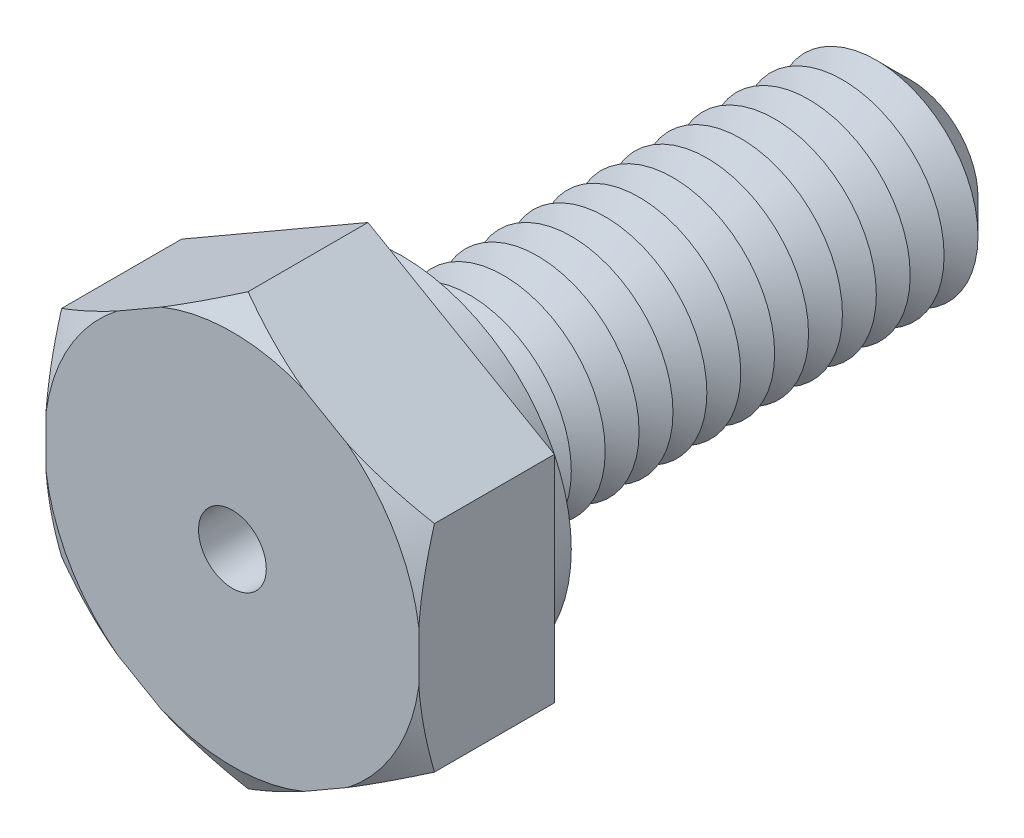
ISO-10303-21;
HEADER;
FILE_DESCRIPTION(('STEP AP214'),'2;1');
FILE_NAME('part.step','',(''),(''),'','','');
FILE_SCHEMA(('AUTOMOTIVE_DESIGN { 1 0 10303 214 1 1 1 1 }'));
ENDSEC;
DATA;
#1=APPLICATION_CONTEXT('core data for automotive mechanical design processes');
#2=APPLICATION_PROTOCOL_DEFINITION('international standard','automotive_design',2000,#1);
#3=PRODUCT_CONTEXT('',#1,'mechanical');
#4=PRODUCT('Part','Part','',(#3));
#5=PRODUCT_RELATED_PRODUCT_CATEGORY('part','',(#4));
#6=PRODUCT_DEFINITION_FORMATION('','',#4);
#7=PRODUCT_DEFINITION_CONTEXT('part definition',#1,'design');
#8=PRODUCT_DEFINITION('design','',#6,#7);
#9=PRODUCT_DEFINITION_SHAPE('','',#8);
#10=(LENGTH_UNIT() NAMED_UNIT(*) SI_UNIT(.MILLI.,.METRE.));
#11=(NAMED_UNIT(*) PLANE_ANGLE_UNIT() SI_UNIT($,.RADIAN.));
#12=(NAMED_UNIT(*) SI_UNIT($,.STERADIAN.) SOLID_ANGLE_UNIT());
#13=UNCERTAINTY_MEASURE_WITH_UNIT(LENGTH_MEASURE(1.E-05),#10,'distance_accuracy_value','');
#14=(GEOMETRIC_REPRESENTATION_CONTEXT(3) GLOBAL_UNCERTAINTY_ASSIGNED_CONTEXT((#13)) GLOBAL_UNIT_ASSIGNED_CONTEXT((#10,
#11,#12)) REPRESENTATION_CONTEXT('',''));
#15=CARTESIAN_POINT('',(0.,0.,0.));
#16=DIRECTION('',(0.,0.,1.));
#17=DIRECTION('',(1.,0.,0.));
#18=AXIS2_PLACEMENT_3D('',#15,#16,#17);
#19=CARTESIAN_POINT('',(2.75,1.58771324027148,2.));
#20=DIRECTION('',(-0.5,-0.866025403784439,0.));
#21=DIRECTION('',(0.866025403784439,-0.5,0.));
#22=AXIS2_PLACEMENT_3D('',#19,#20,#21);
#23=PLANE('',#22);
#24=CARTESIAN_POINT('',(4.66048793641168,0.484692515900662,0.897146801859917));
#25=CARTESIAN_POINT('',(4.57407924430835,0.53458059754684,0.94377821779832));
#26=CARTESIAN_POINT('',(4.48746398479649,0.584587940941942,0.989906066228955));
#27=CARTESIAN_POINT('',(4.31373297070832,0.684891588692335,1.08092005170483));
#28=CARTESIAN_POINT('',(4.22661715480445,0.735187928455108,1.12580603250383));
#29=CARTESIAN_POINT('',(4.05153903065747,0.836269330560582,1.21423144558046));
#30=CARTESIAN_POINT('',(3.96357490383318,0.887055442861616,1.25776609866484));
#31=CARTESIAN_POINT('',(3.78698874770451,0.989007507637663,1.34300583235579));
#32=CARTESIAN_POINT('',(3.69836673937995,1.04017344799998,1.38471097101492));
#33=CARTESIAN_POINT('',(3.42682968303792,1.196945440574,1.50858888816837));
#34=CARTESIAN_POINT('',(3.2426849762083,1.30326143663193,1.58723569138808));
#35=CARTESIAN_POINT('',(2.87039319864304,1.51820419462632,1.73037556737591));
#36=CARTESIAN_POINT('',(2.68225085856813,1.62682822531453,1.7948844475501));
#37=CARTESIAN_POINT('',(2.36072167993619,1.81246318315,1.88587189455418));
#38=CARTESIAN_POINT('',(2.22854222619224,1.88877702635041,1.91793719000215));
#39=CARTESIAN_POINT('',(1.9623222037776,2.04247922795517,1.96931401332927));
#40=CARTESIAN_POINT('',(1.82828230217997,2.11986720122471,1.98862999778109));
#41=CARTESIAN_POINT('',(1.56075616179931,2.27432349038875,2.0122791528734));
#42=CARTESIAN_POINT('',(1.42728171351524,2.35138499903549,2.01678452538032));
#43=CARTESIAN_POINT('',(1.16057863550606,2.50536609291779,2.01073620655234));
#44=CARTESIAN_POINT('',(1.02735002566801,2.58228566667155,2.00018134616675));
#45=CARTESIAN_POINT('',(0.804211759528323,2.71111460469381,1.97079823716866));
#46=CARTESIAN_POINT('',(0.713917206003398,2.76324618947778,1.95563842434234));
#47=CARTESIAN_POINT('',(0.534175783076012,2.86701994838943,1.91960186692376));
#48=CARTESIAN_POINT('',(0.444729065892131,2.91866203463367,1.89872411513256));
#49=CARTESIAN_POINT('',(0.266714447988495,3.02143882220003,1.85203328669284));
#50=CARTESIAN_POINT('',(0.17814764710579,3.07257288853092,1.82621469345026));
#51=CARTESIAN_POINT('',(0.0020075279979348,3.17426743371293,1.77045729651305));
#52=CARTESIAN_POINT('',(-0.08556585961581,3.22482795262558,1.74051878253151));
#53=CARTESIAN_POINT('',(-0.260818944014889,3.3260103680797,1.67685588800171));
#54=CARTESIAN_POINT('',(-0.348487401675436,3.37662577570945,1.64309053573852));
#55=CARTESIAN_POINT('',(-0.522893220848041,3.47731902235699,1.57271678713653));
#56=CARTESIAN_POINT('',(-0.609631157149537,3.52739719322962,1.53611027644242));
#57=CARTESIAN_POINT('',(-0.868655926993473,3.67694521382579,1.4228111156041));
#58=CARTESIAN_POINT('',(-1.03979736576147,3.775753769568,1.34262239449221));
#59=CARTESIAN_POINT('',(-1.26895816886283,3.90805982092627,1.23025748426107));
#60=CARTESIAN_POINT('',(-1.32802105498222,3.94215979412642,1.20084468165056));
#61=CARTESIAN_POINT('',(-1.44588766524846,4.01021011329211,1.14133764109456));
#62=CARTESIAN_POINT('',(-1.50469139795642,4.0441604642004,1.11124342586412));
#63=CARTESIAN_POINT('',(-1.67950896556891,4.14509143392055,1.02069737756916));
#64=CARTESIAN_POINT('',(-1.79518197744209,4.2118752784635,0.959363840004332));
#65=CARTESIAN_POINT('',(-1.91048793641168,4.27844720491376,0.897146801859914));
#66=B_SPLINE_CURVE_WITH_KNOTS('',3,(#24,#25,#26,#27,#28,#29,#30,#31,#32,#33,#34,#35,#36,#37,#38,
#39,#40,#41,#42,#43,#44,#45,#46,#47,#48,#49,#50,#51,#52,#53,#54,#55,#56,#57,#58,#59,#60,#61,#62,
#63,#64,#65),.UNSPECIFIED.,.F.,.F.,(4,2,2,2,2,2,2,2,2,2,2,2,2,2,2,2,2,2,2,2,4),(0.,
0.330408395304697,0.660858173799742,0.992367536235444,1.32386637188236,2.00369971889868,
2.68276903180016,3.15022294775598,3.61751337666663,4.0793510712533,4.54122461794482,
4.85714368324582,5.17311843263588,5.4894480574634,5.80575544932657,6.12584332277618,
6.44572054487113,7.08531613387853,7.30813289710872,7.5309422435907,7.97184194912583),.UNSPECIFIED.);
#67=CARTESIAN_POINT('',(2.75,1.58771324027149,1.76905989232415));
#68=VERTEX_POINT('',#67);
#69=CARTESIAN_POINT('',(1.69960608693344,2.1941584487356,2.));
#70=VERTEX_POINT('',#69);
#71=EDGE_CURVE('E132',#68,#70,#66,.T.);
#72=ORIENTED_EDGE('',*,*,#71,.F.);
#73=DIRECTION('',(0.,0.,-1.));
#74=VECTOR('',#73,1.);
#75=CARTESIAN_POINT('',(2.75,1.58771324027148,2.));
#76=LINE('',#75,#74);
#77=CARTESIAN_POINT('',(2.75,1.58771324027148,0.));
#78=VERTEX_POINT('',#77);
#79=EDGE_CURVE('E144',#68,#78,#76,.T.);
#80=ORIENTED_EDGE('',*,*,#79,.T.);
#81=DIRECTION('',(-0.866025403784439,0.5,0.));
#82=VECTOR('',#81,1.);
#83=CARTESIAN_POINT('',(2.75,1.58771324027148,0.));
#84=LINE('',#83,#82);
#85=CARTESIAN_POINT('',(0.,3.17542648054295,0.));
#86=VERTEX_POINT('',#85);
#87=EDGE_CURVE('E239',#78,#86,#84,.T.);
#88=ORIENTED_EDGE('',*,*,#87,.T.);
#89=DIRECTION('',(0.,0.,-1.));
#90=VECTOR('',#89,1.);
#91=CARTESIAN_POINT('',(0.,3.17542648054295,2.));
#92=LINE('',#91,#90);
#93=CARTESIAN_POINT('',(0.,3.17542648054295,1.76905989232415));
#94=VERTEX_POINT('',#93);
#95=EDGE_CURVE('E179',#94,#86,#92,.T.);
#96=ORIENTED_EDGE('',*,*,#95,.F.);
#97=CARTESIAN_POINT('',(1.05039391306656,2.56898127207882,2.));
#98=VERTEX_POINT('',#97);
#99=EDGE_CURVE('E151',#98,#94,#66,.T.);
#100=ORIENTED_EDGE('',*,*,#99,.F.);
#101=DIRECTION('',(-0.866025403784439,0.5,0.));
#102=VECTOR('',#101,1.);
#103=CARTESIAN_POINT('',(2.75,1.58771324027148,2.));
#104=LINE('',#103,#102);
#105=EDGE_CURVE('E148',#70,#98,#104,.T.);
#106=ORIENTED_EDGE('',*,*,#105,.F.);
#107=EDGE_LOOP('',(#72,#80,#88,#96,#100,#106));
#108=FACE_BOUND('',#107,.T.);
#109=ADVANCED_FACE('F39',(#108),#23,.F.);
#110=CARTESIAN_POINT('',(0.,3.17542648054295,2.));
#111=DIRECTION('',(0.5,-0.866025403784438,0.));
#112=DIRECTION('',(0.866025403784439,0.5,0.));
#113=AXIS2_PLACEMENT_3D('',#110,#111,#112);
#114=PLANE('',#113);
#115=CARTESIAN_POINT('',(1.91048793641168,4.27844720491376,0.897146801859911));
#116=CARTESIAN_POINT('',(1.82407924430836,4.22855912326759,0.943778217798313));
#117=CARTESIAN_POINT('',(1.7374639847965,4.17855177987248,0.989906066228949));
#118=CARTESIAN_POINT('',(1.56373297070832,4.07824813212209,1.08092005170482));
#119=CARTESIAN_POINT('',(1.47661715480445,4.02795179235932,1.12580603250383));
#120=CARTESIAN_POINT('',(1.30153903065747,3.92687039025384,1.21423144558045));
#121=CARTESIAN_POINT('',(1.21357490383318,3.87608427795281,1.25776609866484));
#122=CARTESIAN_POINT('',(1.03698874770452,3.77413221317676,1.34300583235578));
#123=CARTESIAN_POINT('',(0.948366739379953,3.72296627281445,1.38471097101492));
#124=CARTESIAN_POINT('',(0.676829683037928,3.56619428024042,1.50858888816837));
#125=CARTESIAN_POINT('',(0.492684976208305,3.4598782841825,1.58723569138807));
#126=CARTESIAN_POINT('',(0.120393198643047,3.24493552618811,1.73037556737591));
#127=CARTESIAN_POINT('',(-0.0677491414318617,3.1363114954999,1.7948844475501));
#128=CARTESIAN_POINT('',(-0.389278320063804,2.95067653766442,1.88587189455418));
#129=CARTESIAN_POINT('',(-0.521457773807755,2.87436269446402,1.91793719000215));
#130=CARTESIAN_POINT('',(-0.787677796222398,2.72066049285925,1.96931401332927));
#131=CARTESIAN_POINT('',(-0.921717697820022,2.64327251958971,1.98862999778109));
#132=CARTESIAN_POINT('',(-1.18924383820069,2.48881623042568,2.0122791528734));
#133=CARTESIAN_POINT('',(-1.32271828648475,2.41175472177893,2.01678452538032));
#134=CARTESIAN_POINT('',(-1.58942136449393,2.25777362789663,2.01073620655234));
#135=CARTESIAN_POINT('',(-1.72264997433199,2.18085405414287,2.00018134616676));
#136=CARTESIAN_POINT('',(-1.94578824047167,2.05202511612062,1.97079823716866));
#137=CARTESIAN_POINT('',(-2.03608279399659,1.99989353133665,1.95563842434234));
#138=CARTESIAN_POINT('',(-2.21582421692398,1.896119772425,1.91960186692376));
#139=CARTESIAN_POINT('',(-2.30527093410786,1.84447768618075,1.89872411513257));
#140=CARTESIAN_POINT('',(-2.48328555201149,1.7417008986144,1.85203328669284));
#141=CARTESIAN_POINT('',(-2.5718523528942,1.69056683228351,1.82621469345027));
#142=CARTESIAN_POINT('',(-2.74799247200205,1.5888722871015,1.77045729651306));
#143=CARTESIAN_POINT('',(-2.8355658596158,1.53831176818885,1.74051878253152));
#144=CARTESIAN_POINT('',(-3.01081894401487,1.43712935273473,1.67685588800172));
#145=CARTESIAN_POINT('',(-3.09848740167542,1.38651394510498,1.64309053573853));
#146=CARTESIAN_POINT('',(-3.27289322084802,1.28582069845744,1.57271678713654));
#147=CARTESIAN_POINT('',(-3.35963115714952,1.23574252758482,1.53611027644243));
#148=CARTESIAN_POINT('',(-3.61865592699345,1.08619450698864,1.42281111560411));
#149=CARTESIAN_POINT('',(-3.78979736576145,0.987385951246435,1.34262239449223));
#150=CARTESIAN_POINT('',(-4.01895816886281,0.855079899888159,1.23025748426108));
#151=CARTESIAN_POINT('',(-4.0780210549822,0.820979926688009,1.20084468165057));
#152=CARTESIAN_POINT('',(-4.19588766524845,0.752929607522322,1.14133764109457));
#153=CARTESIAN_POINT('',(-4.25469139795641,0.718979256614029,1.11124342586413));
#154=CARTESIAN_POINT('',(-4.42950896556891,0.618048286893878,1.02069737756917));
#155=CARTESIAN_POINT('',(-4.54518197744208,0.551264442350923,0.959363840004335));
#156=CARTESIAN_POINT('',(-4.66048793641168,0.484692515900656,0.897146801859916));
#157=B_SPLINE_CURVE_WITH_KNOTS('',3,(#115,#116,#117,#118,#119,#120,#121,#122,#123,#124,#125,
#126,#127,#128,#129,#130,#131,#132,#133,#134,#135,#136,#137,#138,#139,#140,#141,#142,#143,#144,
#145,#146,#147,#148,#149,#150,#151,#152,#153,#154,#155,#156),.UNSPECIFIED.,.F.,.F.,(4,2,2,2,2,2,
2,2,2,2,2,2,2,2,2,2,2,2,2,2,4),(0.,0.330408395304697,0.660858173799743,0.992367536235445,
1.32386637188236,2.00369971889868,2.68276903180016,3.15022294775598,3.61751337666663,
4.0793510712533,4.54122461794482,4.85714368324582,5.17311843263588,5.48944805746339,
5.80575544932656,6.12584332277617,6.44572054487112,7.08531613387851,7.30813289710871,
7.5309422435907,7.97184194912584),.UNSPECIFIED.);
#158=CARTESIAN_POINT('',(-1.05039391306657,2.56898127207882,2.));
#159=VERTEX_POINT('',#158);
#160=EDGE_CURVE('E382',#94,#159,#157,.T.);
#161=ORIENTED_EDGE('',*,*,#160,.F.);
#162=ORIENTED_EDGE('',*,*,#95,.T.);
#163=DIRECTION('',(-0.866025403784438,-0.5,0.));
#164=VECTOR('',#163,1.);
#165=CARTESIAN_POINT('',(0.,3.17542648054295,0.));
#166=LINE('',#165,#164);
#167=CARTESIAN_POINT('',(-2.75,1.58771324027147,0.));
#168=VERTEX_POINT('',#167);
#169=EDGE_CURVE('E242',#86,#168,#166,.T.);
#170=ORIENTED_EDGE('',*,*,#169,.T.);
#171=DIRECTION('',(0.,0.,-1.));
#172=VECTOR('',#171,1.);
#173=CARTESIAN_POINT('',(-2.75,1.58771324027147,2.));
#174=LINE('',#173,#172);
#175=CARTESIAN_POINT('',(-2.75,1.58771324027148,1.76905989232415));
#176=VERTEX_POINT('',#175);
#177=EDGE_CURVE('E176',#176,#168,#174,.T.);
#178=ORIENTED_EDGE('',*,*,#177,.F.);
#179=CARTESIAN_POINT('',(-1.69960608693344,2.1941584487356,2.));
#180=VERTEX_POINT('',#179);
#181=EDGE_CURVE('E374',#180,#176,#157,.T.);
#182=ORIENTED_EDGE('',*,*,#181,.F.);
#183=DIRECTION('',(-0.866025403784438,-0.5,0.));
#184=VECTOR('',#183,1.);
#185=CARTESIAN_POINT('',(0.,3.17542648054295,2.));
#186=LINE('',#185,#184);
#187=EDGE_CURVE('E218',#159,#180,#186,.T.);
#188=ORIENTED_EDGE('',*,*,#187,.F.);
#189=EDGE_LOOP('',(#161,#162,#170,#178,#182,#188));
#190=FACE_BOUND('',#189,.T.);
#191=ADVANCED_FACE('F388',(#190),#114,.F.);
#192=CARTESIAN_POINT('',(-2.75,1.58771324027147,2.));
#193=DIRECTION('',(1.,0.,0.));
#194=DIRECTION('',(0.,0.,-1.));
#195=AXIS2_PLACEMENT_3D('',#192,#193,#194);
#196=PLANE('',#195);
#197=CARTESIAN_POINT('',(-2.75,3.49820117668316,1.03335245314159));
#198=CARTESIAN_POINT('',(-2.75,3.3988452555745,1.07843728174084));
#199=CARTESIAN_POINT('',(-2.75,3.29921780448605,1.12293477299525));
#200=CARTESIAN_POINT('',(-2.75,3.09930320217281,1.21047025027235));
#201=CARTESIAN_POINT('',(-2.75,2.99901593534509,1.25350797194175));
#202=CARTESIAN_POINT('',(-2.75,2.79728071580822,1.33799855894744));
#203=CARTESIAN_POINT('',(-2.75,2.69582966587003,1.37944406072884));
#204=CARTESIAN_POINT('',(-2.75,2.49207131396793,1.46016516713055));
#205=CARTESIAN_POINT('',(-2.75,2.38976405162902,1.49944087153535));
#206=CARTESIAN_POINT('',(-2.75,2.18462050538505,1.57517230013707));
#207=CARTESIAN_POINT('',(-2.75,2.0817886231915,1.61163983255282));
#208=CARTESIAN_POINT('',(-2.75,1.87503931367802,1.68134876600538));
#209=CARTESIAN_POINT('',(-2.75,1.7711218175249,1.71458996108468));
#210=CARTESIAN_POINT('',(-2.75,1.45784948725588,1.80833694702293));
#211=CARTESIAN_POINT('',(-2.75,1.24663799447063,1.86299520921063));
#212=CARTESIAN_POINT('',(-2.75,0.880007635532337,1.93741428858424));
#213=CARTESIAN_POINT('',(-2.75,0.725721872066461,1.96267397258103));
#214=CARTESIAN_POINT('',(-2.75,0.415477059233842,1.99905142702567));
#215=CARTESIAN_POINT('',(-2.75,0.259518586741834,2.01017392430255));
#216=CARTESIAN_POINT('',(-2.75,-0.052664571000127,2.01694102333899));
#217=CARTESIAN_POINT('',(-2.75,-0.208889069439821,2.01259389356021));
#218=CARTESIAN_POINT('',(-2.75,-0.520179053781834,1.98898893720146));
#219=CARTESIAN_POINT('',(-2.75,-0.675244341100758,1.96972861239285));
#220=CARTESIAN_POINT('',(-2.75,-1.0603123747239,1.90556109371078));
#221=CARTESIAN_POINT('',(-2.75,-1.28896433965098,1.85264132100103));
#222=CARTESIAN_POINT('',(-2.75,-1.62776674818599,1.75827794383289));
#223=CARTESIAN_POINT('',(-2.75,-1.74015276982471,1.72427052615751));
#224=CARTESIAN_POINT('',(-2.75,-1.96362143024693,1.65220283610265));
#225=CARTESIAN_POINT('',(-2.75,-2.07470418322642,1.61414292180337));
#226=CARTESIAN_POINT('',(-2.75,-2.2969572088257,1.53431422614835));
#227=CARTESIAN_POINT('',(-2.75,-2.40811380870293,1.49250783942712));
#228=CARTESIAN_POINT('',(-2.75,-2.62938860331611,1.40621968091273));
#229=CARTESIAN_POINT('',(-2.75,-2.73950673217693,1.36173774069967));
#230=CARTESIAN_POINT('',(-2.75,-2.95816234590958,1.27090723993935));
#231=CARTESIAN_POINT('',(-2.75,-3.06670540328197,1.22457202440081));
#232=CARTESIAN_POINT('',(-2.75,-3.2830047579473,1.130169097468));
#233=CARTESIAN_POINT('',(-2.75,-3.39076124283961,1.08210181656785));
#234=CARTESIAN_POINT('',(-2.75,-3.49820117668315,1.03335245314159));
#235=B_SPLINE_CURVE_WITH_KNOTS('',3,(#197,#198,#199,#200,#201,#202,#203,#204,#205,#206,#207,
#208,#209,#210,#211,#212,#213,#214,#215,#216,#217,#218,#219,#220,#221,#222,#223,#224,#225,#226,
#227,#228,#229,#230,#231,#232,#233,#234),.UNSPECIFIED.,.F.,.F.,(4,2,2,2,2,2,2,2,2,2,2,2,2,2,2,2,
2,2,4),(0.,0.327324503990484,0.654707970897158,0.983457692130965,1.31219228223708,
1.63945907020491,1.96674673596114,2.62024190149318,3.08872929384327,3.55706000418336,
4.02514043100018,4.49329928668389,5.19584793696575,5.54806763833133,5.9002562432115,
6.25649337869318,6.61275296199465,6.96679459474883,7.32074883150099),.UNSPECIFIED.);
#236=CARTESIAN_POINT('',(-2.75,0.374822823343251,2.));
#237=VERTEX_POINT('',#236);
#238=EDGE_CURVE('E225',#176,#237,#235,.T.);
#239=ORIENTED_EDGE('',*,*,#238,.F.);
#240=ORIENTED_EDGE('',*,*,#177,.T.);
#241=DIRECTION('',(0.,-1.,0.));
#242=VECTOR('',#241,1.);
#243=CARTESIAN_POINT('',(-2.75,1.58771324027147,0.));
#244=LINE('',#243,#242);
#245=CARTESIAN_POINT('',(-2.75,-1.58771324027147,0.));
#246=VERTEX_POINT('',#245);
#247=EDGE_CURVE('E246',#168,#246,#244,.T.);
#248=ORIENTED_EDGE('',*,*,#247,.T.);
#249=DIRECTION('',(0.,0.,-1.));
#250=VECTOR('',#249,1.);
#251=CARTESIAN_POINT('',(-2.75,-1.58771324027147,2.));
#252=LINE('',#251,#250);
#253=CARTESIAN_POINT('',(-2.75000000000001,-1.58771324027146,1.76905989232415));
#254=VERTEX_POINT('',#253);
#255=EDGE_CURVE('E173',#254,#246,#252,.T.);
#256=ORIENTED_EDGE('',*,*,#255,.F.);
#257=CARTESIAN_POINT('',(-2.75,-0.374822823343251,2.));
#258=VERTEX_POINT('',#257);
#259=EDGE_CURVE('E228',#258,#254,#235,.T.);
#260=ORIENTED_EDGE('',*,*,#259,.F.);
#261=DIRECTION('',(0.,-1.,0.));
#262=VECTOR('',#261,1.);
#263=CARTESIAN_POINT('',(-2.75,1.58771324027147,2.));
#264=LINE('',#263,#262);
#265=EDGE_CURVE('E216',#237,#258,#264,.T.);
#266=ORIENTED_EDGE('',*,*,#265,.F.);
#267=EDGE_LOOP('',(#239,#240,#248,#256,#260,#266));
#268=FACE_BOUND('',#267,.T.);
#269=ADVANCED_FACE('F224',(#268),#196,.F.);
#270=CARTESIAN_POINT('',(-2.75,-1.58771324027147,2.));
#271=DIRECTION('',(0.5,0.866025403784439,0.));
#272=DIRECTION('',(-0.866025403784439,0.5,0.));
#273=AXIS2_PLACEMENT_3D('',#270,#271,#272);
#274=PLANE('',#273);
#275=CARTESIAN_POINT('',(-4.66048793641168,-0.48469251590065,0.897146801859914));
#276=CARTESIAN_POINT('',(-4.57407924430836,-0.534580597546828,0.943778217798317));
#277=CARTESIAN_POINT('',(-4.4874639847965,-0.58458794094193,0.989906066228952));
#278=CARTESIAN_POINT('',(-4.31373297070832,-0.684891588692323,1.08092005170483));
#279=CARTESIAN_POINT('',(-4.22661715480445,-0.735187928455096,1.12580603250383));
#280=CARTESIAN_POINT('',(-4.05153903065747,-0.836269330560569,1.21423144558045));
#281=CARTESIAN_POINT('',(-3.96357490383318,-0.887055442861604,1.25776609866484));
#282=CARTESIAN_POINT('',(-3.78698874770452,-0.989007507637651,1.34300583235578));
#283=CARTESIAN_POINT('',(-3.69836673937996,-1.04017344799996,1.38471097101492));
#284=CARTESIAN_POINT('',(-3.42682968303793,-1.19694544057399,1.50858888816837));
#285=CARTESIAN_POINT('',(-3.24268497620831,-1.30326143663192,1.58723569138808));
#286=CARTESIAN_POINT('',(-2.87039319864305,-1.5182041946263,1.73037556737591));
#287=CARTESIAN_POINT('',(-2.68225085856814,-1.62682822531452,1.7948844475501));
#288=CARTESIAN_POINT('',(-2.3607216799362,-1.81246318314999,1.88587189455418));
#289=CARTESIAN_POINT('',(-2.22854222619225,-1.8887770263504,1.91793719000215));
#290=CARTESIAN_POINT('',(-1.96232220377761,-2.04247922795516,1.96931401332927));
#291=CARTESIAN_POINT('',(-1.82828230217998,-2.1198672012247,1.9886299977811));
#292=CARTESIAN_POINT('',(-1.56075616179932,-2.27432349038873,2.0122791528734));
#293=CARTESIAN_POINT('',(-1.42728171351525,-2.35138499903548,2.01678452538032));
#294=CARTESIAN_POINT('',(-1.16057863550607,-2.50536609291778,2.01073620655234));
#295=CARTESIAN_POINT('',(-1.02735002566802,-2.58228566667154,2.00018134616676));
#296=CARTESIAN_POINT('',(-0.804211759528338,-2.71111460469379,1.97079823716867));
#297=CARTESIAN_POINT('',(-0.713917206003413,-2.76324618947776,1.95563842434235));
#298=CARTESIAN_POINT('',(-0.534175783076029,-2.86701994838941,1.91960186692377));
#299=CARTESIAN_POINT('',(-0.444729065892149,-2.91866203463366,1.89872411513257));
#300=CARTESIAN_POINT('',(-0.266714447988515,-3.02143882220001,1.85203328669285));
#301=CARTESIAN_POINT('',(-0.178147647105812,-3.0725728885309,1.82621469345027));
#302=CARTESIAN_POINT('',(-0.00200752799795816,-3.17426743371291,1.77045729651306));
#303=CARTESIAN_POINT('',(0.0855658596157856,-3.22482795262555,1.74051878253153));
#304=CARTESIAN_POINT('',(0.260818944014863,-3.32601036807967,1.67685588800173));
#305=CARTESIAN_POINT('',(0.348487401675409,-3.37662577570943,1.64309053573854));
#306=CARTESIAN_POINT('',(0.522893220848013,-3.47731902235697,1.57271678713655));
#307=CARTESIAN_POINT('',(0.609631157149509,-3.52739719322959,1.53611027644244));
#308=CARTESIAN_POINT('',(0.868655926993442,-3.67694521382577,1.42281111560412));
#309=CARTESIAN_POINT('',(1.03979736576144,-3.77575376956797,1.34262239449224));
#310=CARTESIAN_POINT('',(1.26895816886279,-3.90805982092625,1.23025748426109));
#311=CARTESIAN_POINT('',(1.32802105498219,-3.9421597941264,1.20084468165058));
#312=CARTESIAN_POINT('',(1.44588766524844,-4.01021011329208,1.14133764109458));
#313=CARTESIAN_POINT('',(1.5046913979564,-4.04416046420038,1.11124342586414));
#314=CARTESIAN_POINT('',(1.6795089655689,-4.14509143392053,1.02069737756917));
#315=CARTESIAN_POINT('',(1.79518197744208,-4.21187527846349,0.959363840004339));
#316=CARTESIAN_POINT('',(1.91048793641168,-4.27844720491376,0.897146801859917));
#317=B_SPLINE_CURVE_WITH_KNOTS('',3,(#275,#276,#277,#278,#279,#280,#281,#282,#283,#284,#285,
#286,#287,#288,#289,#290,#291,#292,#293,#294,#295,#296,#297,#298,#299,#300,#301,#302,#303,#304,
#305,#306,#307,#308,#309,#310,#311,#312,#313,#314,#315,#316),.UNSPECIFIED.,.F.,.F.,(4,2,2,2,2,2,
2,2,2,2,2,2,2,2,2,2,2,2,2,2,4),(0.,0.330408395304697,0.660858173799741,0.992367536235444,
1.32386637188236,2.00369971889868,2.68276903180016,3.15022294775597,3.61751337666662,
4.0793510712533,4.54122461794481,4.85714368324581,5.17311843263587,5.48944805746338,
5.80575544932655,6.12584332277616,6.44572054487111,7.08531613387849,7.3081328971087,
7.53094224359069,7.97184194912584),.UNSPECIFIED.);
#318=CARTESIAN_POINT('',(-1.69960608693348,-2.19415844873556,2.));
#319=VERTEX_POINT('',#318);
#320=EDGE_CURVE('E424',#254,#319,#317,.T.);
#321=ORIENTED_EDGE('',*,*,#320,.F.);
#322=ORIENTED_EDGE('',*,*,#255,.T.);
#323=DIRECTION('',(0.866025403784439,-0.5,0.));
#324=VECTOR('',#323,1.);
#325=CARTESIAN_POINT('',(-2.75,-1.58771324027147,0.));
#326=LINE('',#325,#324);
#327=CARTESIAN_POINT('',(0.,-3.17542648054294,0.));
#328=VERTEX_POINT('',#327);
#329=EDGE_CURVE('E249',#246,#328,#326,.T.);
#330=ORIENTED_EDGE('',*,*,#329,.T.);
#331=DIRECTION('',(0.,0.,-1.));
#332=VECTOR('',#331,1.);
#333=CARTESIAN_POINT('',(0.,-3.17542648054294,2.));
#334=LINE('',#333,#332);
#335=CARTESIAN_POINT('',(0.,-3.17542648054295,1.76905989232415));
#336=VERTEX_POINT('',#335);
#337=EDGE_CURVE('E163',#336,#328,#334,.T.);
#338=ORIENTED_EDGE('',*,*,#337,.F.);
#339=CARTESIAN_POINT('',(-1.05039391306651,-2.56898127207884,2.));
#340=VERTEX_POINT('',#339);
#341=EDGE_CURVE('E419',#340,#336,#317,.T.);
#342=ORIENTED_EDGE('',*,*,#341,.F.);
#343=DIRECTION('',(0.866025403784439,-0.5,0.));
#344=VECTOR('',#343,1.);
#345=CARTESIAN_POINT('',(-2.75,-1.58771324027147,2.));
#346=LINE('',#345,#344);
#347=EDGE_CURVE('E229',#319,#340,#346,.T.);
#348=ORIENTED_EDGE('',*,*,#347,.F.);
#349=EDGE_LOOP('',(#321,#322,#330,#338,#342,#348));
#350=FACE_BOUND('',#349,.T.);
#351=ADVANCED_FACE('F425',(#350),#274,.F.);
#352=CARTESIAN_POINT('',(0.,-3.17542648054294,2.));
#353=DIRECTION('',(-0.5,0.866025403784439,0.));
#354=DIRECTION('',(-0.866025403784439,-0.5,0.));
#355=AXIS2_PLACEMENT_3D('',#352,#353,#354);
#356=PLANE('',#355);
#357=CARTESIAN_POINT('',(-1.91048793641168,-4.27844720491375,0.897146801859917));
#358=CARTESIAN_POINT('',(-1.82407924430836,-4.22855912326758,0.94377821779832));
#359=CARTESIAN_POINT('',(-1.73746398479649,-4.17855177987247,0.989906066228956));
#360=CARTESIAN_POINT('',(-1.56373297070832,-4.07824813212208,1.08092005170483));
#361=CARTESIAN_POINT('',(-1.47661715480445,-4.02795179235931,1.12580603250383));
#362=CARTESIAN_POINT('',(-1.30153903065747,-3.92687039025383,1.21423144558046));
#363=CARTESIAN_POINT('',(-1.21357490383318,-3.8760842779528,1.25776609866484));
#364=CARTESIAN_POINT('',(-1.03698874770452,-3.77413221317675,1.34300583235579));
#365=CARTESIAN_POINT('',(-0.948366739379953,-3.72296627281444,1.38471097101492));
#366=CARTESIAN_POINT('',(-0.676829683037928,-3.56619428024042,1.50858888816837));
#367=CARTESIAN_POINT('',(-0.492684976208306,-3.45987828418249,1.58723569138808));
#368=CARTESIAN_POINT('',(-0.120393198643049,-3.2449355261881,1.73037556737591));
#369=CARTESIAN_POINT('',(0.0677491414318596,-3.13631149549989,1.7948844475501));
#370=CARTESIAN_POINT('',(0.389278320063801,-2.95067653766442,1.88587189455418));
#371=CARTESIAN_POINT('',(0.521457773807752,-2.87436269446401,1.91793719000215));
#372=CARTESIAN_POINT('',(0.787677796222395,-2.72066049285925,1.96931401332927));
#373=CARTESIAN_POINT('',(0.921717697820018,-2.64327251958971,1.9886299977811));
#374=CARTESIAN_POINT('',(1.18924383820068,-2.48881623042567,2.0122791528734));
#375=CARTESIAN_POINT('',(1.32271828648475,-2.41175472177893,2.01678452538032));
#376=CARTESIAN_POINT('',(1.58942136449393,-2.25777362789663,2.01073620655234));
#377=CARTESIAN_POINT('',(1.72264997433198,-2.18085405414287,2.00018134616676));
#378=CARTESIAN_POINT('',(1.94578824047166,-2.05202511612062,1.97079823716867));
#379=CARTESIAN_POINT('',(2.03608279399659,-1.99989353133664,1.95563842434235));
#380=CARTESIAN_POINT('',(2.21582421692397,-1.89611977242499,1.91960186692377));
#381=CARTESIAN_POINT('',(2.30527093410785,-1.84447768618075,1.89872411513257));
#382=CARTESIAN_POINT('',(2.48328555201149,-1.7417008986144,1.85203328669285));
#383=CARTESIAN_POINT('',(2.57185235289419,-1.69056683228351,1.82621469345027));
#384=CARTESIAN_POINT('',(2.74799247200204,-1.58887228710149,1.77045729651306));
#385=CARTESIAN_POINT('',(2.83556585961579,-1.53831176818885,1.74051878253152));
#386=CARTESIAN_POINT('',(3.01081894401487,-1.43712935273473,1.67685588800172));
#387=CARTESIAN_POINT('',(3.09848740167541,-1.38651394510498,1.64309053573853));
#388=CARTESIAN_POINT('',(3.27289322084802,-1.28582069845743,1.57271678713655));
#389=CARTESIAN_POINT('',(3.35963115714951,-1.23574252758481,1.53611027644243));
#390=CARTESIAN_POINT('',(3.61865592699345,-1.08619450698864,1.42281111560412));
#391=CARTESIAN_POINT('',(3.78979736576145,-0.987385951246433,1.34262239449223));
#392=CARTESIAN_POINT('',(4.0189581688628,-0.855079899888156,1.23025748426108));
#393=CARTESIAN_POINT('',(4.0780210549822,-0.820979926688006,1.20084468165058));
#394=CARTESIAN_POINT('',(4.19588766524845,-0.752929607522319,1.14133764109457));
#395=CARTESIAN_POINT('',(4.2546913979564,-0.718979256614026,1.11124342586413));
#396=CARTESIAN_POINT('',(4.4295089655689,-0.618048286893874,1.02069737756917));
#397=CARTESIAN_POINT('',(4.54518197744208,-0.551264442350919,0.959363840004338));
#398=CARTESIAN_POINT('',(4.66048793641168,-0.484692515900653,0.897146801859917));
#399=B_SPLINE_CURVE_WITH_KNOTS('',3,(#357,#358,#359,#360,#361,#362,#363,#364,#365,#366,#367,
#368,#369,#370,#371,#372,#373,#374,#375,#376,#377,#378,#379,#380,#381,#382,#383,#384,#385,#386,
#387,#388,#389,#390,#391,#392,#393,#394,#395,#396,#397,#398),.UNSPECIFIED.,.F.,.F.,(4,2,2,2,2,2,
2,2,2,2,2,2,2,2,2,2,2,2,2,2,4),(0.,0.330408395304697,0.660858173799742,0.992367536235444,
1.32386637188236,2.00369971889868,2.68276903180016,3.15022294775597,3.61751337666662,
4.0793510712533,4.54122461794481,4.85714368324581,5.17311843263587,5.48944805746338,
5.80575544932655,6.12584332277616,6.44572054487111,7.0853161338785,7.3081328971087,
7.53094224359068,7.97184194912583),.UNSPECIFIED.);
#400=CARTESIAN_POINT('',(1.05039391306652,-2.56898127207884,2.));
#401=VERTEX_POINT('',#400);
#402=EDGE_CURVE('E64',#336,#401,#399,.T.);
#403=ORIENTED_EDGE('',*,*,#402,.F.);
#404=ORIENTED_EDGE('',*,*,#337,.T.);
#405=DIRECTION('',(0.866025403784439,0.5,0.));
#406=VECTOR('',#405,1.);
#407=CARTESIAN_POINT('',(0.,-3.17542648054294,0.));
#408=LINE('',#407,#406);
#409=CARTESIAN_POINT('',(2.75,-1.58771324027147,0.));
#410=VERTEX_POINT('',#409);
#411=EDGE_CURVE('E252',#328,#410,#408,.T.);
#412=ORIENTED_EDGE('',*,*,#411,.T.);
#413=DIRECTION('',(0.,0.,-1.));
#414=VECTOR('',#413,1.);
#415=CARTESIAN_POINT('',(2.75,-1.58771324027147,2.));
#416=LINE('',#415,#414);
#417=CARTESIAN_POINT('',(2.75,-1.58771324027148,1.76905989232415));
#418=VERTEX_POINT('',#417);
#419=EDGE_CURVE('E157',#418,#410,#416,.T.);
#420=ORIENTED_EDGE('',*,*,#419,.F.);
#421=CARTESIAN_POINT('',(1.69960608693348,-2.19415844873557,2.));
#422=VERTEX_POINT('',#421);
#423=EDGE_CURVE('E414',#422,#418,#399,.T.);
#424=ORIENTED_EDGE('',*,*,#423,.F.);
#425=DIRECTION('',(0.866025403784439,0.5,0.));
#426=VECTOR('',#425,1.);
#427=CARTESIAN_POINT('',(0.,-3.17542648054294,2.));
#428=LINE('',#427,#426);
#429=EDGE_CURVE('E166',#401,#422,#428,.T.);
#430=ORIENTED_EDGE('',*,*,#429,.F.);
#431=EDGE_LOOP('',(#403,#404,#412,#420,#424,#430));
#432=FACE_BOUND('',#431,.T.);
#433=ADVANCED_FACE('F428',(#432),#356,.F.);
#434=CARTESIAN_POINT('',(2.75,-1.58771324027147,2.));
#435=DIRECTION('',(-1.,0.,0.));
#436=DIRECTION('',(0.,-1.,0.));
#437=AXIS2_PLACEMENT_3D('',#434,#435,#436);
#438=PLANE('',#437);
#439=CARTESIAN_POINT('',(2.75,-3.49820117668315,1.03335245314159));
#440=CARTESIAN_POINT('',(2.75,-3.3988452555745,1.07843728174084));
#441=CARTESIAN_POINT('',(2.75,-3.29921780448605,1.12293477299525));
#442=CARTESIAN_POINT('',(2.75,-3.0993032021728,1.21047025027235));
#443=CARTESIAN_POINT('',(2.75,-2.99901593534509,1.25350797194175));
#444=CARTESIAN_POINT('',(2.75,-2.79728071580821,1.33799855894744));
#445=CARTESIAN_POINT('',(2.75,-2.69582966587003,1.37944406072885));
#446=CARTESIAN_POINT('',(2.75,-2.49207131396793,1.46016516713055));
#447=CARTESIAN_POINT('',(2.75,-2.38976405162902,1.49944087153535));
#448=CARTESIAN_POINT('',(2.75,-2.18462050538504,1.57517230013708));
#449=CARTESIAN_POINT('',(2.75,-2.08178862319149,1.61163983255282));
#450=CARTESIAN_POINT('',(2.75,-1.87503931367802,1.68134876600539));
#451=CARTESIAN_POINT('',(2.75,-1.77112181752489,1.71458996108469));
#452=CARTESIAN_POINT('',(2.75,-1.45784948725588,1.80833694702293));
#453=CARTESIAN_POINT('',(2.75,-1.24663799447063,1.86299520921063));
#454=CARTESIAN_POINT('',(2.75,-0.880007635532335,1.93741428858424));
#455=CARTESIAN_POINT('',(2.75,-0.72572187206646,1.96267397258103));
#456=CARTESIAN_POINT('',(2.75,-0.41547705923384,1.99905142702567));
#457=CARTESIAN_POINT('',(2.75,-0.259518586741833,2.01017392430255));
#458=CARTESIAN_POINT('',(2.75,0.052664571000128,2.01694102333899));
#459=CARTESIAN_POINT('',(2.75,0.208889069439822,2.01259389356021));
#460=CARTESIAN_POINT('',(2.75,0.520179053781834,1.98898893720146));
#461=CARTESIAN_POINT('',(2.75,0.675244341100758,1.96972861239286));
#462=CARTESIAN_POINT('',(2.75,1.0603123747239,1.90556109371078));
#463=CARTESIAN_POINT('',(2.75,1.28896433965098,1.85264132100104));
#464=CARTESIAN_POINT('',(2.75,1.627766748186,1.75827794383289));
#465=CARTESIAN_POINT('',(2.75,1.74015276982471,1.72427052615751));
#466=CARTESIAN_POINT('',(2.75,1.96362143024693,1.65220283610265));
#467=CARTESIAN_POINT('',(2.75,2.07470418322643,1.61414292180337));
#468=CARTESIAN_POINT('',(2.75,2.2969572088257,1.53431422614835));
#469=CARTESIAN_POINT('',(2.75,2.40811380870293,1.49250783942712));
#470=CARTESIAN_POINT('',(2.75,2.62938860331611,1.40621968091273));
#471=CARTESIAN_POINT('',(2.75,2.73950673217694,1.36173774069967));
#472=CARTESIAN_POINT('',(2.75,2.95816234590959,1.27090723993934));
#473=CARTESIAN_POINT('',(2.75,3.06670540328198,1.22457202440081));
#474=CARTESIAN_POINT('',(2.75,3.28300475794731,1.130169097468));
#475=CARTESIAN_POINT('',(2.75,3.39076124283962,1.08210181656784));
#476=CARTESIAN_POINT('',(2.75,3.49820117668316,1.03335245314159));
#477=B_SPLINE_CURVE_WITH_KNOTS('',3,(#439,#440,#441,#442,#443,#444,#445,#446,#447,#448,#449,
#450,#451,#452,#453,#454,#455,#456,#457,#458,#459,#460,#461,#462,#463,#464,#465,#466,#467,#468,
#469,#470,#471,#472,#473,#474,#475,#476),.UNSPECIFIED.,.F.,.F.,(4,2,2,2,2,2,2,2,2,2,2,2,2,2,2,2,
2,2,4),(0.,0.327324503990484,0.654707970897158,0.983457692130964,1.31219228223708,
1.63945907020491,1.96674673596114,2.62024190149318,3.08872929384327,3.55706000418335,
4.02514043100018,4.49329928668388,5.19584793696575,5.54806763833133,5.9002562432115,
6.25649337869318,6.61275296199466,6.96679459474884,7.320748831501),.UNSPECIFIED.);
#478=CARTESIAN_POINT('',(2.75,-0.374822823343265,2.));
#479=VERTEX_POINT('',#478);
#480=EDGE_CURVE('E56',#418,#479,#477,.T.);
#481=ORIENTED_EDGE('',*,*,#480,.F.);
#482=ORIENTED_EDGE('',*,*,#419,.T.);
#483=DIRECTION('',(0.,1.,0.));
#484=VECTOR('',#483,1.);
#485=CARTESIAN_POINT('',(2.75,-1.58771324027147,0.));
#486=LINE('',#485,#484);
#487=EDGE_CURVE('E154',#410,#78,#486,.T.);
#488=ORIENTED_EDGE('',*,*,#487,.T.);
#489=ORIENTED_EDGE('',*,*,#79,.F.);
#490=CARTESIAN_POINT('',(2.75,0.374822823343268,2.));
#491=VERTEX_POINT('',#490);
#492=EDGE_CURVE('E129',#491,#68,#477,.T.);
#493=ORIENTED_EDGE('',*,*,#492,.F.);
#494=DIRECTION('',(0.,1.,0.));
#495=VECTOR('',#494,1.);
#496=CARTESIAN_POINT('',(2.75,-1.58771324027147,2.));
#497=LINE('',#496,#495);
#498=EDGE_CURVE('E158',#479,#491,#497,.T.);
#499=ORIENTED_EDGE('',*,*,#498,.F.);
#500=EDGE_LOOP('',(#481,#482,#488,#489,#493,#499));
#501=FACE_BOUND('',#500,.T.);
#502=ADVANCED_FACE('F152',(#501),#438,.F.);
#503=CARTESIAN_POINT('',(0.,0.,2.));
#504=DIRECTION('',(0.,0.,1.));
#505=DIRECTION('',(1.,0.,0.));
#506=AXIS2_PLACEMENT_3D('',#503,#504,#505);
#507=PLANE('',#506);
#508=CARTESIAN_POINT('',(0.,0.,2.));
#509=DIRECTION('',(0.,0.,1.));
#510=DIRECTION('',(1.,0.,0.));
#511=AXIS2_PLACEMENT_3D('',#508,#509,#510);
#512=CIRCLE('',#511,0.5);
#513=CARTESIAN_POINT('',(0.5,0.,2.));
#514=VERTEX_POINT('',#513);
#515=EDGE_CURVE('E912',#514,#514,#512,.T.);
#516=ORIENTED_EDGE('',*,*,#515,.F.);
#517=EDGE_LOOP('',(#516));
#518=FACE_BOUND('',#517,.T.);
#519=ORIENTED_EDGE('',*,*,#498,.T.);
#520=CARTESIAN_POINT('',(0.,0.,2.));
#521=DIRECTION('',(0.,0.,1.));
#522=DIRECTION('',(1.,0.,0.));
#523=AXIS2_PLACEMENT_3D('',#520,#521,#522);
#524=CIRCLE('',#523,2.77542648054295);
#525=EDGE_CURVE('E134',#491,#70,#524,.T.);
#526=ORIENTED_EDGE('',*,*,#525,.T.);
#527=ORIENTED_EDGE('',*,*,#105,.T.);
#528=CARTESIAN_POINT('',(0.,0.,2.));
#529=DIRECTION('',(0.,0.,1.));
#530=DIRECTION('',(1.,0.,0.));
#531=AXIS2_PLACEMENT_3D('',#528,#529,#530);
#532=CIRCLE('',#531,2.77542648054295);
#533=EDGE_CURVE('E11',#98,#159,#532,.T.);
#534=ORIENTED_EDGE('',*,*,#533,.T.);
#535=ORIENTED_EDGE('',*,*,#187,.T.);
#536=EDGE_CURVE('E49',#180,#237,#532,.T.);
#537=ORIENTED_EDGE('',*,*,#536,.T.);
#538=ORIENTED_EDGE('',*,*,#265,.T.);
#539=EDGE_CURVE('E199',#258,#319,#532,.T.);
#540=ORIENTED_EDGE('',*,*,#539,.T.);
#541=ORIENTED_EDGE('',*,*,#347,.T.);
#542=EDGE_CURVE('E193',#340,#401,#532,.T.);
#543=ORIENTED_EDGE('',*,*,#542,.T.);
#544=ORIENTED_EDGE('',*,*,#429,.T.);
#545=EDGE_CURVE('E43',#422,#479,#532,.T.);
#546=ORIENTED_EDGE('',*,*,#545,.T.);
#547=EDGE_LOOP('',(#519,#526,#527,#534,#535,#537,#538,#540,#541,#543,#544,#546));
#548=FACE_BOUND('',#547,.T.);
#549=ADVANCED_FACE('F215',(#518,#548),#507,.T.);
#550=CARTESIAN_POINT('',(0.,0.,0.));
#551=DIRECTION('',(0.,0.,1.));
#552=DIRECTION('',(1.,0.,0.));
#553=AXIS2_PLACEMENT_3D('',#550,#551,#552);
#554=PLANE('',#553);
#555=CARTESIAN_POINT('',(0.,0.,0.));
#556=DIRECTION('',(0.,0.,1.));
#557=DIRECTION('',(1.,0.,0.));
#558=AXIS2_PLACEMENT_3D('',#555,#556,#557);
#559=CIRCLE('',#558,2.5);
#560=CARTESIAN_POINT('',(2.5,0.,0.));
#561=VERTEX_POINT('',#560);
#562=EDGE_CURVE('E182',#561,#561,#559,.F.);
#563=ORIENTED_EDGE('',*,*,#562,.F.);
#564=EDGE_LOOP('',(#563));
#565=FACE_BOUND('',#564,.T.);
#566=ORIENTED_EDGE('',*,*,#87,.F.);
#567=ORIENTED_EDGE('',*,*,#487,.F.);
#568=ORIENTED_EDGE('',*,*,#411,.F.);
#569=ORIENTED_EDGE('',*,*,#329,.F.);
#570=ORIENTED_EDGE('',*,*,#247,.F.);
#571=ORIENTED_EDGE('',*,*,#169,.F.);
#572=EDGE_LOOP('',(#566,#567,#568,#569,#570,#571));
#573=FACE_BOUND('',#572,.T.);
#574=ADVANCED_FACE('F472',(#565,#573),#554,.F.);
#575=CARTESIAN_POINT('',(0.,0.,-0.5));
#576=DIRECTION('',(0.,0.,1.));
#577=DIRECTION('',(1.,0.,0.));
#578=AXIS2_PLACEMENT_3D('',#575,#576,#577);
#579=CYLINDRICAL_SURFACE('',#578,2.5);
#580=CARTESIAN_POINT('',(0.,0.,-0.5));
#581=DIRECTION('',(0.,0.,-1.));
#582=DIRECTION('',(-1.,0.,0.));
#583=AXIS2_PLACEMENT_3D('',#580,#581,#582);
#584=CIRCLE('',#583,2.5);
#585=CARTESIAN_POINT('',(-2.5,0.,-0.5));
#586=VERTEX_POINT('',#585);
#587=EDGE_CURVE('E243',#586,#586,#584,.T.);
#588=ORIENTED_EDGE('',*,*,#587,.F.);
#589=EDGE_LOOP('',(#588));
#590=FACE_BOUND('',#589,.T.);
#591=ORIENTED_EDGE('',*,*,#562,.T.);
#592=EDGE_LOOP('',(#591));
#593=FACE_BOUND('',#592,.T.);
#594=ADVANCED_FACE('F483',(#590,#593),#579,.T.);
#595=CARTESIAN_POINT('',(0.,0.,-0.5));
#596=DIRECTION('',(0.,0.,-1.));
#597=DIRECTION('',(-1.,0.,0.));
#598=AXIS2_PLACEMENT_3D('',#595,#596,#597);
#599=PLANE('',#598);
#600=CARTESIAN_POINT('',(0.,0.,-0.5));
#601=DIRECTION('',(0.,0.,1.));
#602=DIRECTION('',(1.,0.,0.));
#603=AXIS2_PLACEMENT_3D('',#600,#601,#602);
#604=CIRCLE('',#603,1.5);
#605=CARTESIAN_POINT('',(1.5,0.,-0.5));
#606=VERTEX_POINT('',#605);
#607=EDGE_CURVE('E269',#606,#606,#604,.T.);
#608=ORIENTED_EDGE('',*,*,#607,.T.);
#609=EDGE_LOOP('',(#608));
#610=FACE_BOUND('',#609,.T.);
#611=ORIENTED_EDGE('',*,*,#587,.T.);
#612=EDGE_LOOP('',(#611));
#613=FACE_BOUND('',#612,.T.);
#614=ADVANCED_FACE('F492',(#610,#613),#599,.T.);
#615=CARTESIAN_POINT('',(0.,0.,-0.5));
#616=DIRECTION('',(0.,0.,1.));
#617=DIRECTION('',(1.,0.,0.));
#618=AXIS2_PLACEMENT_3D('',#615,#616,#617);
#619=CONICAL_SURFACE('',#618,1.5,1.0471975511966);
#620=CARTESIAN_POINT('',(0.,0.,-0.75));
#621=DIRECTION('',(0.,0.,1.));
#622=DIRECTION('',(1.,0.,0.));
#623=AXIS2_PLACEMENT_3D('',#620,#621,#622);
#624=CIRCLE('',#623,1.06698729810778);
#625=CARTESIAN_POINT('',(1.06698729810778,0.,-0.75));
#626=VERTEX_POINT('',#625);
#627=EDGE_CURVE('E272',#626,#626,#624,.T.);
#628=ORIENTED_EDGE('',*,*,#627,.T.);
#629=EDGE_LOOP('',(#628));
#630=FACE_BOUND('',#629,.T.);
#631=ORIENTED_EDGE('',*,*,#607,.F.);
#632=EDGE_LOOP('',(#631));
#633=FACE_BOUND('',#632,.T.);
#634=ADVANCED_FACE('F501',(#630,#633),#619,.T.);
#635=CARTESIAN_POINT('',(0.,0.,-0.75));
#636=DIRECTION('',(0.,0.,-1.));
#637=DIRECTION('',(-1.,0.,0.));
#638=AXIS2_PLACEMENT_3D('',#635,#636,#637);
#639=CONICAL_SURFACE('',#638,1.06698729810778,1.0471975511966);
#640=CARTESIAN_POINT('',(0.,0.,-1.));
#641=DIRECTION('',(0.,0.,1.));
#642=DIRECTION('',(1.,0.,0.));
#643=AXIS2_PLACEMENT_3D('',#640,#641,#642);
#644=CIRCLE('',#643,1.5);
#645=CARTESIAN_POINT('',(1.5,0.,-1.));
#646=VERTEX_POINT('',#645);
#647=EDGE_CURVE('E276',#646,#646,#644,.T.);
#648=ORIENTED_EDGE('',*,*,#647,.T.);
#649=EDGE_LOOP('',(#648));
#650=FACE_BOUND('',#649,.T.);
#651=ORIENTED_EDGE('',*,*,#627,.F.);
#652=EDGE_LOOP('',(#651));
#653=FACE_BOUND('',#652,.T.);
#654=ADVANCED_FACE('F511',(#650,#653),#639,.T.);
#655=CARTESIAN_POINT('',(0.,0.,-1.));
#656=DIRECTION('',(0.,0.,1.));
#657=DIRECTION('',(1.,0.,0.));
#658=AXIS2_PLACEMENT_3D('',#655,#656,#657);
#659=CONICAL_SURFACE('',#658,1.5,1.0471975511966);
#660=CARTESIAN_POINT('',(0.,0.,-1.25));
#661=DIRECTION('',(0.,0.,1.));
#662=DIRECTION('',(1.,0.,0.));
#663=AXIS2_PLACEMENT_3D('',#660,#661,#662);
#664=CIRCLE('',#663,1.06698729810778);
#665=CARTESIAN_POINT('',(1.06698729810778,0.,-1.25));
#666=VERTEX_POINT('',#665);
#667=EDGE_CURVE('E279',#666,#666,#664,.T.);
#668=ORIENTED_EDGE('',*,*,#667,.T.);
#669=EDGE_LOOP('',(#668));
#670=FACE_BOUND('',#669,.T.);
#671=ORIENTED_EDGE('',*,*,#647,.F.);
#672=EDGE_LOOP('',(#671));
#673=FACE_BOUND('',#672,.T.);
#674=ADVANCED_FACE('F520',(#670,#673),#659,.T.);
#675=CARTESIAN_POINT('',(0.,0.,-1.25));
#676=DIRECTION('',(0.,0.,-1.));
#677=DIRECTION('',(-1.,0.,0.));
#678=AXIS2_PLACEMENT_3D('',#675,#676,#677);
#679=CONICAL_SURFACE('',#678,1.06698729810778,1.0471975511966);
#680=CARTESIAN_POINT('',(0.,0.,-1.5));
#681=DIRECTION('',(0.,0.,1.));
#682=DIRECTION('',(1.,0.,0.));
#683=AXIS2_PLACEMENT_3D('',#680,#681,#682);
#684=CIRCLE('',#683,1.5);
#685=CARTESIAN_POINT('',(1.5,0.,-1.5));
#686=VERTEX_POINT('',#685);
#687=EDGE_CURVE('E283',#686,#686,#684,.T.);
#688=ORIENTED_EDGE('',*,*,#687,.T.);
#689=EDGE_LOOP('',(#688));
#690=FACE_BOUND('',#689,.T.);
#691=ORIENTED_EDGE('',*,*,#667,.F.);
#692=EDGE_LOOP('',(#691));
#693=FACE_BOUND('',#692,.T.);
#694=ADVANCED_FACE('F529',(#690,#693),#679,.T.);
#695=CARTESIAN_POINT('',(0.,0.,-1.5));
#696=DIRECTION('',(0.,0.,1.));
#697=DIRECTION('',(1.,0.,0.));
#698=AXIS2_PLACEMENT_3D('',#695,#696,#697);
#699=CONICAL_SURFACE('',#698,1.5,1.0471975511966);
#700=CARTESIAN_POINT('',(0.,0.,-1.75));
#701=DIRECTION('',(0.,0.,1.));
#702=DIRECTION('',(1.,0.,0.));
#703=AXIS2_PLACEMENT_3D('',#700,#701,#702);
#704=CIRCLE('',#703,1.06698729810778);
#705=CARTESIAN_POINT('',(1.06698729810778,0.,-1.75));
#706=VERTEX_POINT('',#705);
#707=EDGE_CURVE('E286',#706,#706,#704,.T.);
#708=ORIENTED_EDGE('',*,*,#707,.T.);
#709=EDGE_LOOP('',(#708));
#710=FACE_BOUND('',#709,.T.);
#711=ORIENTED_EDGE('',*,*,#687,.F.);
#712=EDGE_LOOP('',(#711));
#713=FACE_BOUND('',#712,.T.);
#714=ADVANCED_FACE('F538',(#710,#713),#699,.T.);
#715=CARTESIAN_POINT('',(0.,0.,-1.75));
#716=DIRECTION('',(0.,0.,-1.));
#717=DIRECTION('',(-1.,0.,0.));
#718=AXIS2_PLACEMENT_3D('',#715,#716,#717);
#719=CONICAL_SURFACE('',#718,1.06698729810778,1.0471975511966);
#720=CARTESIAN_POINT('',(0.,0.,-2.));
#721=DIRECTION('',(0.,0.,1.));
#722=DIRECTION('',(1.,0.,0.));
#723=AXIS2_PLACEMENT_3D('',#720,#721,#722);
#724=CIRCLE('',#723,1.5);
#725=CARTESIAN_POINT('',(1.5,0.,-2.));
#726=VERTEX_POINT('',#725);
#727=EDGE_CURVE('E289',#726,#726,#724,.T.);
#728=ORIENTED_EDGE('',*,*,#727,.T.);
#729=EDGE_LOOP('',(#728));
#730=FACE_BOUND('',#729,.T.);
#731=ORIENTED_EDGE('',*,*,#707,.F.);
#732=EDGE_LOOP('',(#731));
#733=FACE_BOUND('',#732,.T.);
#734=ADVANCED_FACE('F547',(#730,#733),#719,.T.);
#735=CARTESIAN_POINT('',(0.,0.,-2.));
#736=DIRECTION('',(0.,0.,1.));
#737=DIRECTION('',(1.,0.,0.));
#738=AXIS2_PLACEMENT_3D('',#735,#736,#737);
#739=CONICAL_SURFACE('',#738,1.5,1.0471975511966);
#740=CARTESIAN_POINT('',(0.,0.,-2.25));
#741=DIRECTION('',(0.,0.,1.));
#742=DIRECTION('',(1.,0.,0.));
#743=AXIS2_PLACEMENT_3D('',#740,#741,#742);
#744=CIRCLE('',#743,1.06698729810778);
#745=CARTESIAN_POINT('',(1.06698729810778,0.,-2.25));
#746=VERTEX_POINT('',#745);
#747=EDGE_CURVE('E293',#746,#746,#744,.T.);
#748=ORIENTED_EDGE('',*,*,#747,.T.);
#749=EDGE_LOOP('',(#748));
#750=FACE_BOUND('',#749,.T.);
#751=ORIENTED_EDGE('',*,*,#727,.F.);
#752=EDGE_LOOP('',(#751));
#753=FACE_BOUND('',#752,.T.);
#754=ADVANCED_FACE('F556',(#750,#753),#739,.T.);
#755=CARTESIAN_POINT('',(0.,0.,-2.25));
#756=DIRECTION('',(0.,0.,-1.));
#757=DIRECTION('',(-1.,0.,0.));
#758=AXIS2_PLACEMENT_3D('',#755,#756,#757);
#759=CONICAL_SURFACE('',#758,1.06698729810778,1.0471975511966);
#760=CARTESIAN_POINT('',(0.,0.,-2.5));
#761=DIRECTION('',(0.,0.,1.));
#762=DIRECTION('',(1.,0.,0.));
#763=AXIS2_PLACEMENT_3D('',#760,#761,#762);
#764=CIRCLE('',#763,1.5);
#765=CARTESIAN_POINT('',(1.5,0.,-2.5));
#766=VERTEX_POINT('',#765);
#767=EDGE_CURVE('E297',#766,#766,#764,.T.);
#768=ORIENTED_EDGE('',*,*,#767,.T.);
#769=EDGE_LOOP('',(#768));
#770=FACE_BOUND('',#769,.T.);
#771=ORIENTED_EDGE('',*,*,#747,.F.);
#772=EDGE_LOOP('',(#771));
#773=FACE_BOUND('',#772,.T.);
#774=ADVANCED_FACE('F565',(#770,#773),#759,.T.);
#775=CARTESIAN_POINT('',(0.,0.,-2.5));
#776=DIRECTION('',(0.,0.,1.));
#777=DIRECTION('',(1.,0.,0.));
#778=AXIS2_PLACEMENT_3D('',#775,#776,#777);
#779=CONICAL_SURFACE('',#778,1.5,1.0471975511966);
#780=CARTESIAN_POINT('',(0.,0.,-2.75));
#781=DIRECTION('',(0.,0.,1.));
#782=DIRECTION('',(1.,0.,0.));
#783=AXIS2_PLACEMENT_3D('',#780,#781,#782);
#784=CIRCLE('',#783,1.06698729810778);
#785=CARTESIAN_POINT('',(1.06698729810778,0.,-2.75));
#786=VERTEX_POINT('',#785);
#787=EDGE_CURVE('E300',#786,#786,#784,.T.);
#788=ORIENTED_EDGE('',*,*,#787,.T.);
#789=EDGE_LOOP('',(#788));
#790=FACE_BOUND('',#789,.T.);
#791=ORIENTED_EDGE('',*,*,#767,.F.);
#792=EDGE_LOOP('',(#791));
#793=FACE_BOUND('',#792,.T.);
#794=ADVANCED_FACE('F574',(#790,#793),#779,.T.);
#795=CARTESIAN_POINT('',(0.,0.,-2.75));
#796=DIRECTION('',(0.,0.,-1.));
#797=DIRECTION('',(-1.,0.,0.));
#798=AXIS2_PLACEMENT_3D('',#795,#796,#797);
#799=CONICAL_SURFACE('',#798,1.06698729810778,1.0471975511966);
#800=CARTESIAN_POINT('',(0.,0.,-3.));
#801=DIRECTION('',(0.,0.,1.));
#802=DIRECTION('',(1.,0.,0.));
#803=AXIS2_PLACEMENT_3D('',#800,#801,#802);
#804=CIRCLE('',#803,1.5);
#805=CARTESIAN_POINT('',(1.5,0.,-3.));
#806=VERTEX_POINT('',#805);
#807=EDGE_CURVE('E303',#806,#806,#804,.T.);
#808=ORIENTED_EDGE('',*,*,#807,.T.);
#809=EDGE_LOOP('',(#808));
#810=FACE_BOUND('',#809,.T.);
#811=ORIENTED_EDGE('',*,*,#787,.F.);
#812=EDGE_LOOP('',(#811));
#813=FACE_BOUND('',#812,.T.);
#814=ADVANCED_FACE('F583',(#810,#813),#799,.T.);
#815=CARTESIAN_POINT('',(0.,0.,-3.));
#816=DIRECTION('',(0.,0.,1.));
#817=DIRECTION('',(1.,0.,0.));
#818=AXIS2_PLACEMENT_3D('',#815,#816,#817);
#819=CONICAL_SURFACE('',#818,1.5,1.0471975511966);
#820=CARTESIAN_POINT('',(0.,0.,-3.25));
#821=DIRECTION('',(0.,0.,1.));
#822=DIRECTION('',(1.,0.,0.));
#823=AXIS2_PLACEMENT_3D('',#820,#821,#822);
#824=CIRCLE('',#823,1.06698729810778);
#825=CARTESIAN_POINT('',(1.06698729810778,0.,-3.25));
#826=VERTEX_POINT('',#825);
#827=EDGE_CURVE('E307',#826,#826,#824,.T.);
#828=ORIENTED_EDGE('',*,*,#827,.T.);
#829=EDGE_LOOP('',(#828));
#830=FACE_BOUND('',#829,.T.);
#831=ORIENTED_EDGE('',*,*,#807,.F.);
#832=EDGE_LOOP('',(#831));
#833=FACE_BOUND('',#832,.T.);
#834=ADVANCED_FACE('F592',(#830,#833),#819,.T.);
#835=CARTESIAN_POINT('',(0.,0.,-3.25));
#836=DIRECTION('',(0.,0.,-1.));
#837=DIRECTION('',(-1.,0.,0.));
#838=AXIS2_PLACEMENT_3D('',#835,#836,#837);
#839=CONICAL_SURFACE('',#838,1.06698729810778,1.0471975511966);
#840=CARTESIAN_POINT('',(0.,0.,-3.5));
#841=DIRECTION('',(0.,0.,1.));
#842=DIRECTION('',(1.,0.,0.));
#843=AXIS2_PLACEMENT_3D('',#840,#841,#842);
#844=CIRCLE('',#843,1.5);
#845=CARTESIAN_POINT('',(1.5,0.,-3.5));
#846=VERTEX_POINT('',#845);
#847=EDGE_CURVE('E311',#846,#846,#844,.T.);
#848=ORIENTED_EDGE('',*,*,#847,.T.);
#849=EDGE_LOOP('',(#848));
#850=FACE_BOUND('',#849,.T.);
#851=ORIENTED_EDGE('',*,*,#827,.F.);
#852=EDGE_LOOP('',(#851));
#853=FACE_BOUND('',#852,.T.);
#854=ADVANCED_FACE('F601',(#850,#853),#839,.T.);
#855=CARTESIAN_POINT('',(0.,0.,-3.5));
#856=DIRECTION('',(0.,0.,1.));
#857=DIRECTION('',(1.,0.,0.));
#858=AXIS2_PLACEMENT_3D('',#855,#856,#857);
#859=CONICAL_SURFACE('',#858,1.5,1.0471975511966);
#860=CARTESIAN_POINT('',(0.,0.,-3.75));
#861=DIRECTION('',(0.,0.,1.));
#862=DIRECTION('',(1.,0.,0.));
#863=AXIS2_PLACEMENT_3D('',#860,#861,#862);
#864=CIRCLE('',#863,1.06698729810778);
#865=CARTESIAN_POINT('',(1.06698729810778,0.,-3.75));
#866=VERTEX_POINT('',#865);
#867=EDGE_CURVE('E315',#866,#866,#864,.T.);
#868=ORIENTED_EDGE('',*,*,#867,.T.);
#869=EDGE_LOOP('',(#868));
#870=FACE_BOUND('',#869,.T.);
#871=ORIENTED_EDGE('',*,*,#847,.F.);
#872=EDGE_LOOP('',(#871));
#873=FACE_BOUND('',#872,.T.);
#874=ADVANCED_FACE('F610',(#870,#873),#859,.T.);
#875=CARTESIAN_POINT('',(0.,0.,-3.75));
#876=DIRECTION('',(0.,0.,-1.));
#877=DIRECTION('',(-1.,0.,0.));
#878=AXIS2_PLACEMENT_3D('',#875,#876,#877);
#879=CONICAL_SURFACE('',#878,1.06698729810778,1.0471975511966);
#880=CARTESIAN_POINT('',(0.,0.,-4.));
#881=DIRECTION('',(0.,0.,1.));
#882=DIRECTION('',(1.,0.,0.));
#883=AXIS2_PLACEMENT_3D('',#880,#881,#882);
#884=CIRCLE('',#883,1.5);
#885=CARTESIAN_POINT('',(1.5,0.,-4.));
#886=VERTEX_POINT('',#885);
#887=EDGE_CURVE('E318',#886,#886,#884,.T.);
#888=ORIENTED_EDGE('',*,*,#887,.T.);
#889=EDGE_LOOP('',(#888));
#890=FACE_BOUND('',#889,.T.);
#891=ORIENTED_EDGE('',*,*,#867,.F.);
#892=EDGE_LOOP('',(#891));
#893=FACE_BOUND('',#892,.T.);
#894=ADVANCED_FACE('F619',(#890,#893),#879,.T.);
#895=CARTESIAN_POINT('',(0.,0.,-4.));
#896=DIRECTION('',(0.,0.,1.));
#897=DIRECTION('',(1.,0.,0.));
#898=AXIS2_PLACEMENT_3D('',#895,#896,#897);
#899=CONICAL_SURFACE('',#898,1.5,1.0471975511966);
#900=CARTESIAN_POINT('',(0.,0.,-4.25));
#901=DIRECTION('',(0.,0.,1.));
#902=DIRECTION('',(1.,0.,0.));
#903=AXIS2_PLACEMENT_3D('',#900,#901,#902);
#904=CIRCLE('',#903,1.06698729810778);
#905=CARTESIAN_POINT('',(1.06698729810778,0.,-4.25));
#906=VERTEX_POINT('',#905);
#907=EDGE_CURVE('E322',#906,#906,#904,.T.);
#908=ORIENTED_EDGE('',*,*,#907,.T.);
#909=EDGE_LOOP('',(#908));
#910=FACE_BOUND('',#909,.T.);
#911=ORIENTED_EDGE('',*,*,#887,.F.);
#912=EDGE_LOOP('',(#911));
#913=FACE_BOUND('',#912,.T.);
#914=ADVANCED_FACE('F628',(#910,#913),#899,.T.);
#915=CARTESIAN_POINT('',(0.,0.,-4.25));
#916=DIRECTION('',(0.,0.,-1.));
#917=DIRECTION('',(-1.,0.,0.));
#918=AXIS2_PLACEMENT_3D('',#915,#916,#917);
#919=CONICAL_SURFACE('',#918,1.06698729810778,1.0471975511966);
#920=CARTESIAN_POINT('',(0.,0.,-4.5));
#921=DIRECTION('',(0.,0.,1.));
#922=DIRECTION('',(1.,0.,0.));
#923=AXIS2_PLACEMENT_3D('',#920,#921,#922);
#924=CIRCLE('',#923,1.5);
#925=CARTESIAN_POINT('',(1.5,0.,-4.5));
#926=VERTEX_POINT('',#925);
#927=EDGE_CURVE('E326',#926,#926,#924,.T.);
#928=ORIENTED_EDGE('',*,*,#927,.T.);
#929=EDGE_LOOP('',(#928));
#930=FACE_BOUND('',#929,.T.);
#931=ORIENTED_EDGE('',*,*,#907,.F.);
#932=EDGE_LOOP('',(#931));
#933=FACE_BOUND('',#932,.T.);
#934=ADVANCED_FACE('F637',(#930,#933),#919,.T.);
#935=CARTESIAN_POINT('',(0.,0.,-4.5));
#936=DIRECTION('',(0.,0.,1.));
#937=DIRECTION('',(1.,0.,0.));
#938=AXIS2_PLACEMENT_3D('',#935,#936,#937);
#939=CONICAL_SURFACE('',#938,1.5,1.0471975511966);
#940=CARTESIAN_POINT('',(0.,0.,-4.75));
#941=DIRECTION('',(0.,0.,1.));
#942=DIRECTION('',(1.,0.,0.));
#943=AXIS2_PLACEMENT_3D('',#940,#941,#942);
#944=CIRCLE('',#943,1.06698729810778);
#945=CARTESIAN_POINT('',(1.06698729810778,0.,-4.75));
#946=VERTEX_POINT('',#945);
#947=EDGE_CURVE('E329',#946,#946,#944,.T.);
#948=ORIENTED_EDGE('',*,*,#947,.T.);
#949=EDGE_LOOP('',(#948));
#950=FACE_BOUND('',#949,.T.);
#951=ORIENTED_EDGE('',*,*,#927,.F.);
#952=EDGE_LOOP('',(#951));
#953=FACE_BOUND('',#952,.T.);
#954=ADVANCED_FACE('F646',(#950,#953),#939,.T.);
#955=CARTESIAN_POINT('',(0.,0.,-4.75));
#956=DIRECTION('',(0.,0.,-1.));
#957=DIRECTION('',(-1.,0.,0.));
#958=AXIS2_PLACEMENT_3D('',#955,#956,#957);
#959=CONICAL_SURFACE('',#958,1.06698729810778,1.0471975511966);
#960=CARTESIAN_POINT('',(0.,0.,-5.));
#961=DIRECTION('',(0.,0.,1.));
#962=DIRECTION('',(1.,0.,0.));
#963=AXIS2_PLACEMENT_3D('',#960,#961,#962);
#964=CIRCLE('',#963,1.5);
#965=CARTESIAN_POINT('',(1.5,0.,-5.));
#966=VERTEX_POINT('',#965);
#967=EDGE_CURVE('E333',#966,#966,#964,.T.);
#968=ORIENTED_EDGE('',*,*,#967,.T.);
#969=EDGE_LOOP('',(#968));
#970=FACE_BOUND('',#969,.T.);
#971=ORIENTED_EDGE('',*,*,#947,.F.);
#972=EDGE_LOOP('',(#971));
#973=FACE_BOUND('',#972,.T.);
#974=ADVANCED_FACE('F655',(#970,#973),#959,.T.);
#975=CARTESIAN_POINT('',(0.,0.,-5.));
#976=DIRECTION('',(0.,0.,1.));
#977=DIRECTION('',(1.,0.,0.));
#978=AXIS2_PLACEMENT_3D('',#975,#976,#977);
#979=CONICAL_SURFACE('',#978,1.5,1.0471975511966);
#980=CARTESIAN_POINT('',(0.,0.,-5.25));
#981=DIRECTION('',(0.,0.,1.));
#982=DIRECTION('',(1.,0.,0.));
#983=AXIS2_PLACEMENT_3D('',#980,#981,#982);
#984=CIRCLE('',#983,1.06698729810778);
#985=CARTESIAN_POINT('',(1.06698729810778,0.,-5.25));
#986=VERTEX_POINT('',#985);
#987=EDGE_CURVE('E337',#986,#986,#984,.T.);
#988=ORIENTED_EDGE('',*,*,#987,.T.);
#989=EDGE_LOOP('',(#988));
#990=FACE_BOUND('',#989,.T.);
#991=ORIENTED_EDGE('',*,*,#967,.F.);
#992=EDGE_LOOP('',(#991));
#993=FACE_BOUND('',#992,.T.);
#994=ADVANCED_FACE('F664',(#990,#993),#979,.T.);
#995=CARTESIAN_POINT('',(0.,0.,-5.25));
#996=DIRECTION('',(0.,0.,-1.));
#997=DIRECTION('',(-1.,0.,0.));
#998=AXIS2_PLACEMENT_3D('',#995,#996,#997);
#999=CONICAL_SURFACE('',#998,1.06698729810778,1.0471975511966);
#1000=CARTESIAN_POINT('',(0.,0.,-5.5));
#1001=DIRECTION('',(0.,0.,1.));
#1002=DIRECTION('',(1.,0.,0.));
#1003=AXIS2_PLACEMENT_3D('',#1000,#1001,#1002);
#1004=CIRCLE('',#1003,1.5);
#1005=CARTESIAN_POINT('',(1.5,0.,-5.5));
#1006=VERTEX_POINT('',#1005);
#1007=EDGE_CURVE('E341',#1006,#1006,#1004,.T.);
#1008=ORIENTED_EDGE('',*,*,#1007,.T.);
#1009=EDGE_LOOP('',(#1008));
#1010=FACE_BOUND('',#1009,.T.);
#1011=ORIENTED_EDGE('',*,*,#987,.F.);
#1012=EDGE_LOOP('',(#1011));
#1013=FACE_BOUND('',#1012,.T.);
#1014=ADVANCED_FACE('F673',(#1010,#1013),#999,.T.);
#1015=CARTESIAN_POINT('',(0.,0.,-5.5));
#1016=DIRECTION('',(0.,0.,1.));
#1017=DIRECTION('',(1.,0.,0.));
#1018=AXIS2_PLACEMENT_3D('',#1015,#1016,#1017);
#1019=CONICAL_SURFACE('',#1018,1.5,1.0471975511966);
#1020=CARTESIAN_POINT('',(0.,0.,-5.75));
#1021=DIRECTION('',(0.,0.,1.));
#1022=DIRECTION('',(1.,0.,0.));
#1023=AXIS2_PLACEMENT_3D('',#1020,#1021,#1022);
#1024=CIRCLE('',#1023,1.06698729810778);
#1025=CARTESIAN_POINT('',(1.06698729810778,0.,-5.75));
#1026=VERTEX_POINT('',#1025);
#1027=EDGE_CURVE('E345',#1026,#1026,#1024,.T.);
#1028=ORIENTED_EDGE('',*,*,#1027,.T.);
#1029=EDGE_LOOP('',(#1028));
#1030=FACE_BOUND('',#1029,.T.);
#1031=ORIENTED_EDGE('',*,*,#1007,.F.);
#1032=EDGE_LOOP('',(#1031));
#1033=FACE_BOUND('',#1032,.T.);
#1034=ADVANCED_FACE('F682',(#1030,#1033),#1019,.T.);
#1035=CARTESIAN_POINT('',(0.,0.,-5.75));
#1036=DIRECTION('',(0.,0.,-1.));
#1037=DIRECTION('',(-1.,0.,0.));
#1038=AXIS2_PLACEMENT_3D('',#1035,#1036,#1037);
#1039=CONICAL_SURFACE('',#1038,1.06698729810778,1.0471975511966);
#1040=CARTESIAN_POINT('',(0.,0.,-6.));
#1041=DIRECTION('',(0.,0.,1.));
#1042=DIRECTION('',(1.,0.,0.));
#1043=AXIS2_PLACEMENT_3D('',#1040,#1041,#1042);
#1044=CIRCLE('',#1043,1.5);
#1045=CARTESIAN_POINT('',(1.5,0.,-6.));
#1046=VERTEX_POINT('',#1045);
#1047=EDGE_CURVE('E349',#1046,#1046,#1044,.T.);
#1048=ORIENTED_EDGE('',*,*,#1047,.T.);
#1049=EDGE_LOOP('',(#1048));
#1050=FACE_BOUND('',#1049,.T.);
#1051=ORIENTED_EDGE('',*,*,#1027,.F.);
#1052=EDGE_LOOP('',(#1051));
#1053=FACE_BOUND('',#1052,.T.);
#1054=ADVANCED_FACE('F691',(#1050,#1053),#1039,.T.);
#1055=CARTESIAN_POINT('',(0.,0.,-6.));
#1056=DIRECTION('',(0.,0.,1.));
#1057=DIRECTION('',(1.,0.,0.));
#1058=AXIS2_PLACEMENT_3D('',#1055,#1056,#1057);
#1059=CONICAL_SURFACE('',#1058,1.5,1.0471975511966);
#1060=CARTESIAN_POINT('',(0.,0.,-6.25));
#1061=DIRECTION('',(0.,0.,1.));
#1062=DIRECTION('',(1.,0.,0.));
#1063=AXIS2_PLACEMENT_3D('',#1060,#1061,#1062);
#1064=CIRCLE('',#1063,1.06698729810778);
#1065=CARTESIAN_POINT('',(1.06698729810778,0.,-6.25));
#1066=VERTEX_POINT('',#1065);
#1067=EDGE_CURVE('E353',#1066,#1066,#1064,.T.);
#1068=ORIENTED_EDGE('',*,*,#1067,.T.);
#1069=EDGE_LOOP('',(#1068));
#1070=FACE_BOUND('',#1069,.T.);
#1071=ORIENTED_EDGE('',*,*,#1047,.F.);
#1072=EDGE_LOOP('',(#1071));
#1073=FACE_BOUND('',#1072,.T.);
#1074=ADVANCED_FACE('F700',(#1070,#1073),#1059,.T.);
#1075=CARTESIAN_POINT('',(0.,0.,-6.25));
#1076=DIRECTION('',(0.,0.,-1.));
#1077=DIRECTION('',(-1.,0.,0.));
#1078=AXIS2_PLACEMENT_3D('',#1075,#1076,#1077);
#1079=CONICAL_SURFACE('',#1078,1.06698729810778,1.0471975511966);
#1080=CARTESIAN_POINT('',(0.,0.,-6.5));
#1081=DIRECTION('',(0.,0.,1.));
#1082=DIRECTION('',(1.,0.,0.));
#1083=AXIS2_PLACEMENT_3D('',#1080,#1081,#1082);
#1084=CIRCLE('',#1083,1.5);
#1085=CARTESIAN_POINT('',(1.5,0.,-6.5));
#1086=VERTEX_POINT('',#1085);
#1087=EDGE_CURVE('E356',#1086,#1086,#1084,.T.);
#1088=ORIENTED_EDGE('',*,*,#1087,.T.);
#1089=EDGE_LOOP('',(#1088));
#1090=FACE_BOUND('',#1089,.T.);
#1091=ORIENTED_EDGE('',*,*,#1067,.F.);
#1092=EDGE_LOOP('',(#1091));
#1093=FACE_BOUND('',#1092,.T.);
#1094=ADVANCED_FACE('F709',(#1090,#1093),#1079,.T.);
#1095=CARTESIAN_POINT('',(0.,0.,-6.5));
#1096=DIRECTION('',(0.,0.,1.));
#1097=DIRECTION('',(1.,0.,0.));
#1098=AXIS2_PLACEMENT_3D('',#1095,#1096,#1097);
#1099=CONICAL_SURFACE('',#1098,1.5,1.0471975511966);
#1100=CARTESIAN_POINT('',(0.,0.,-6.75));
#1101=DIRECTION('',(0.,0.,1.));
#1102=DIRECTION('',(1.,0.,0.));
#1103=AXIS2_PLACEMENT_3D('',#1100,#1101,#1102);
#1104=CIRCLE('',#1103,1.06698729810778);
#1105=CARTESIAN_POINT('',(1.06698729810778,0.,-6.75));
#1106=VERTEX_POINT('',#1105);
#1107=EDGE_CURVE('E360',#1106,#1106,#1104,.T.);
#1108=ORIENTED_EDGE('',*,*,#1107,.T.);
#1109=EDGE_LOOP('',(#1108));
#1110=FACE_BOUND('',#1109,.T.);
#1111=ORIENTED_EDGE('',*,*,#1087,.F.);
#1112=EDGE_LOOP('',(#1111));
#1113=FACE_BOUND('',#1112,.T.);
#1114=ADVANCED_FACE('F718',(#1110,#1113),#1099,.T.);
#1115=CARTESIAN_POINT('',(0.,0.,-6.75));
#1116=DIRECTION('',(0.,0.,-1.));
#1117=DIRECTION('',(-1.,0.,0.));
#1118=AXIS2_PLACEMENT_3D('',#1115,#1116,#1117);
#1119=CONICAL_SURFACE('',#1118,1.06698729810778,1.0471975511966);
#1120=CARTESIAN_POINT('',(0.,0.,-7.));
#1121=DIRECTION('',(0.,0.,1.));
#1122=DIRECTION('',(1.,0.,0.));
#1123=AXIS2_PLACEMENT_3D('',#1120,#1121,#1122);
#1124=CIRCLE('',#1123,1.5);
#1125=CARTESIAN_POINT('',(1.5,0.,-7.));
#1126=VERTEX_POINT('',#1125);
#1127=EDGE_CURVE('E363',#1126,#1126,#1124,.T.);
#1128=ORIENTED_EDGE('',*,*,#1127,.T.);
#1129=EDGE_LOOP('',(#1128));
#1130=FACE_BOUND('',#1129,.T.);
#1131=ORIENTED_EDGE('',*,*,#1107,.F.);
#1132=EDGE_LOOP('',(#1131));
#1133=FACE_BOUND('',#1132,.T.);
#1134=ADVANCED_FACE('F727',(#1130,#1133),#1119,.T.);
#1135=CARTESIAN_POINT('',(0.,0.,-7.));
#1136=DIRECTION('',(0.,0.,1.));
#1137=DIRECTION('',(1.,0.,0.));
#1138=AXIS2_PLACEMENT_3D('',#1135,#1136,#1137);
#1139=CONICAL_SURFACE('',#1138,1.5,1.0471975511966);
#1140=CARTESIAN_POINT('',(0.,0.,-7.25));
#1141=DIRECTION('',(0.,0.,1.));
#1142=DIRECTION('',(1.,0.,0.));
#1143=AXIS2_PLACEMENT_3D('',#1140,#1141,#1142);
#1144=CIRCLE('',#1143,1.06698729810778);
#1145=CARTESIAN_POINT('',(1.06698729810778,0.,-7.25));
#1146=VERTEX_POINT('',#1145);
#1147=EDGE_CURVE('E366',#1146,#1146,#1144,.T.);
#1148=ORIENTED_EDGE('',*,*,#1147,.T.);
#1149=EDGE_LOOP('',(#1148));
#1150=FACE_BOUND('',#1149,.T.);
#1151=ORIENTED_EDGE('',*,*,#1127,.F.);
#1152=EDGE_LOOP('',(#1151));
#1153=FACE_BOUND('',#1152,.T.);
#1154=ADVANCED_FACE('F736',(#1150,#1153),#1139,.T.);
#1155=CARTESIAN_POINT('',(0.,0.,-7.25));
#1156=DIRECTION('',(0.,0.,-1.));
#1157=DIRECTION('',(-1.,0.,0.));
#1158=AXIS2_PLACEMENT_3D('',#1155,#1156,#1157);
#1159=CONICAL_SURFACE('',#1158,1.06698729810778,1.0471975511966);
#1160=CARTESIAN_POINT('',(0.,0.,-7.5));
#1161=DIRECTION('',(0.,0.,1.));
#1162=DIRECTION('',(1.,0.,0.));
#1163=AXIS2_PLACEMENT_3D('',#1160,#1161,#1162);
#1164=CIRCLE('',#1163,1.5);
#1165=CARTESIAN_POINT('',(1.5,0.,-7.5));
#1166=VERTEX_POINT('',#1165);
#1167=EDGE_CURVE('E370',#1166,#1166,#1164,.T.);
#1168=ORIENTED_EDGE('',*,*,#1167,.T.);
#1169=EDGE_LOOP('',(#1168));
#1170=FACE_BOUND('',#1169,.T.);
#1171=ORIENTED_EDGE('',*,*,#1147,.F.);
#1172=EDGE_LOOP('',(#1171));
#1173=FACE_BOUND('',#1172,.T.);
#1174=ADVANCED_FACE('F398',(#1170,#1173),#1159,.T.);
#1175=CARTESIAN_POINT('',(0.,0.,-8.));
#1176=DIRECTION('',(0.,0.,-1.));
#1177=DIRECTION('',(-1.,0.,0.));
#1178=AXIS2_PLACEMENT_3D('',#1175,#1176,#1177);
#1179=PLANE('',#1178);
#1180=CARTESIAN_POINT('',(0.,0.,-8.));
#1181=DIRECTION('',(0.,0.,-1.));
#1182=DIRECTION('',(-1.,0.,0.));
#1183=AXIS2_PLACEMENT_3D('',#1180,#1181,#1182);
#1184=CIRCLE('',#1183,0.5);
#1185=CARTESIAN_POINT('',(-0.5,0.,-8.));
#1186=VERTEX_POINT('',#1185);
#1187=EDGE_CURVE('E915',#1186,#1186,#1184,.F.);
#1188=ORIENTED_EDGE('',*,*,#1187,.T.);
#1189=EDGE_LOOP('',(#1188));
#1190=FACE_BOUND('',#1189,.T.);
#1191=CARTESIAN_POINT('',(0.,0.,-8.));
#1192=DIRECTION('',(0.,0.,-1.));
#1193=DIRECTION('',(-1.,0.,0.));
#1194=AXIS2_PLACEMENT_3D('',#1191,#1192,#1193);
#1195=CIRCLE('',#1194,1.);
#1196=CARTESIAN_POINT('',(-1.,0.,-8.));
#1197=VERTEX_POINT('',#1196);
#1198=EDGE_CURVE('E185',#1197,#1197,#1195,.T.);
#1199=ORIENTED_EDGE('',*,*,#1198,.T.);
#1200=EDGE_LOOP('',(#1199));
#1201=FACE_BOUND('',#1200,.T.);
#1202=ADVANCED_FACE('F752',(#1190,#1201),#1179,.T.);
#1203=CARTESIAN_POINT('',(0.,0.,-8.));
#1204=DIRECTION('',(0.,0.,1.));
#1205=DIRECTION('',(1.,0.,0.));
#1206=AXIS2_PLACEMENT_3D('',#1203,#1204,#1205);
#1207=CONICAL_SURFACE('',#1206,1.,0.785398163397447);
#1208=ORIENTED_EDGE('',*,*,#1167,.F.);
#1209=EDGE_LOOP('',(#1208));
#1210=FACE_BOUND('',#1209,.T.);
#1211=ORIENTED_EDGE('',*,*,#1198,.F.);
#1212=EDGE_LOOP('',(#1211));
#1213=FACE_BOUND('',#1212,.T.);
#1214=ADVANCED_FACE('F41',(#1210,#1213),#1207,.T.);
#1215=CARTESIAN_POINT('',(0.,0.,2.));
#1216=DIRECTION('',(0.,0.,-1.));
#1217=DIRECTION('',(-1.,0.,0.));
#1218=AXIS2_PLACEMENT_3D('',#1215,#1216,#1217);
#1219=CONICAL_SURFACE('',#1218,2.77542648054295,1.0471975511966);
#1220=ORIENTED_EDGE('',*,*,#423,.T.);
#1221=ORIENTED_EDGE('',*,*,#480,.T.);
#1222=ORIENTED_EDGE('',*,*,#545,.F.);
#1223=EDGE_LOOP('',(#1220,#1221,#1222));
#1224=FACE_BOUND('',#1223,.T.);
#1225=ADVANCED_FACE('F767',(#1224),#1219,.T.);
#1226=ORIENTED_EDGE('',*,*,#341,.T.);
#1227=ORIENTED_EDGE('',*,*,#402,.T.);
#1228=ORIENTED_EDGE('',*,*,#542,.F.);
#1229=EDGE_LOOP('',(#1226,#1227,#1228));
#1230=FACE_BOUND('',#1229,.T.);
#1231=ADVANCED_FACE('F774',(#1230),#1219,.T.);
#1232=ORIENTED_EDGE('',*,*,#259,.T.);
#1233=ORIENTED_EDGE('',*,*,#320,.T.);
#1234=ORIENTED_EDGE('',*,*,#539,.F.);
#1235=EDGE_LOOP('',(#1232,#1233,#1234));
#1236=FACE_BOUND('',#1235,.T.);
#1237=ADVANCED_FACE('F781',(#1236),#1219,.T.);
#1238=ORIENTED_EDGE('',*,*,#181,.T.);
#1239=ORIENTED_EDGE('',*,*,#238,.T.);
#1240=ORIENTED_EDGE('',*,*,#536,.F.);
#1241=EDGE_LOOP('',(#1238,#1239,#1240));
#1242=FACE_BOUND('',#1241,.T.);
#1243=ADVANCED_FACE('F395',(#1242),#1219,.T.);
#1244=ORIENTED_EDGE('',*,*,#99,.T.);
#1245=ORIENTED_EDGE('',*,*,#160,.T.);
#1246=ORIENTED_EDGE('',*,*,#533,.F.);
#1247=EDGE_LOOP('',(#1244,#1245,#1246));
#1248=FACE_BOUND('',#1247,.T.);
#1249=ADVANCED_FACE('F390',(#1248),#1219,.T.);
#1250=ORIENTED_EDGE('',*,*,#71,.T.);
#1251=ORIENTED_EDGE('',*,*,#525,.F.);
#1252=ORIENTED_EDGE('',*,*,#492,.T.);
#1253=EDGE_LOOP('',(#1250,#1251,#1252));
#1254=FACE_BOUND('',#1253,.T.);
#1255=ADVANCED_FACE('F131',(#1254),#1219,.T.);
#1256=CARTESIAN_POINT('',(0.,0.,-9.41421356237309));
#1257=DIRECTION('',(0.,0.,1.));
#1258=DIRECTION('',(1.,0.,0.));
#1259=AXIS2_PLACEMENT_3D('',#1256,#1257,#1258);
#1260=CYLINDRICAL_SURFACE('',#1259,0.5);
#1261=ORIENTED_EDGE('',*,*,#515,.T.);
#1262=EDGE_LOOP('',(#1261));
#1263=FACE_BOUND('',#1262,.T.);
#1264=ORIENTED_EDGE('',*,*,#1187,.F.);
#1265=EDGE_LOOP('',(#1264));
#1266=FACE_BOUND('',#1265,.T.);
#1267=ADVANCED_FACE('F397',(#1263,#1266),#1260,.F.);
#1268=CLOSED_SHELL('',(#109,#191,#269,#351,#433,#502,#549,#574,#594,#614,#634,#654,#674,#694,
#714,#734,#754,#774,#794,#814,#834,#854,#874,#894,#914,#934,#954,#974,#994,#1014,#1034,#1054,
#1074,#1094,#1114,#1134,#1154,#1174,#1202,#1214,#1225,#1231,#1237,#1243,#1249,#1255,#1267));
#1269=MANIFOLD_SOLID_BREP('B2',#1268);
#1270=ADVANCED_BREP_SHAPE_REPRESENTATION('',(#18,#1269),#14);
#1271=SHAPE_DEFINITION_REPRESENTATION(#9,#1270);
ENDSEC;
END-ISO-10303-21;
